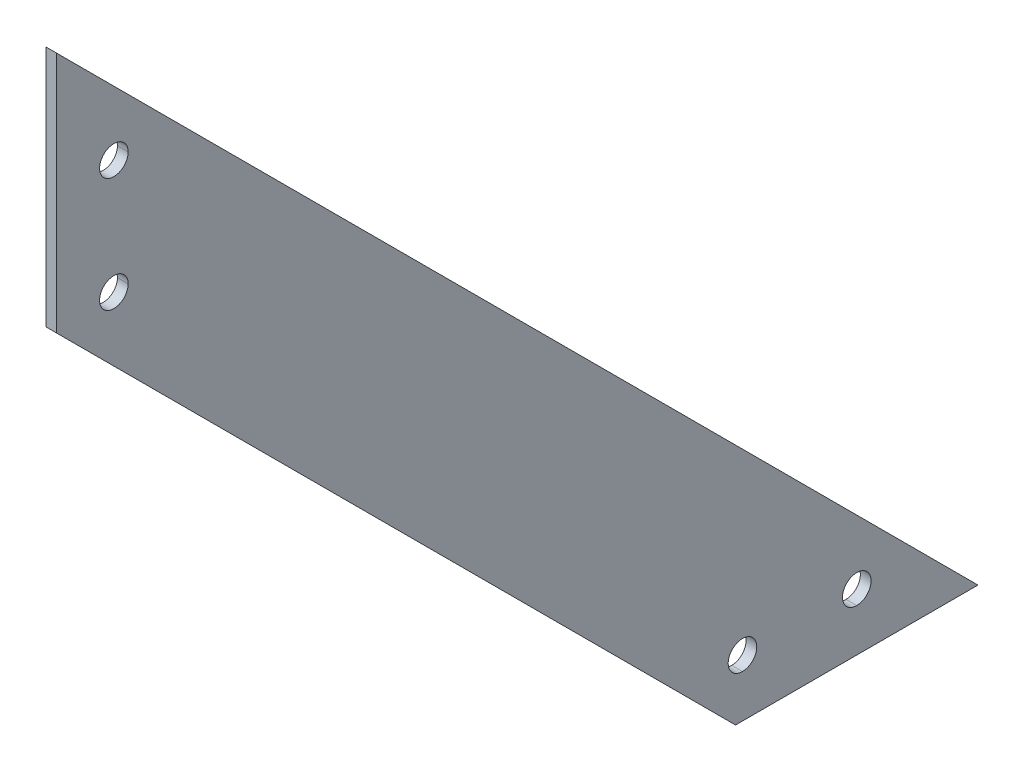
ISO-10303-21;
HEADER;
FILE_DESCRIPTION(('STEP AP214'),'2;1');
FILE_NAME('part.step','',(''),(''),'','','');
FILE_SCHEMA(('AUTOMOTIVE_DESIGN { 1 0 10303 214 1 1 1 1 }'));
ENDSEC;
DATA;
#1=APPLICATION_CONTEXT('core data for automotive mechanical design processes');
#2=APPLICATION_PROTOCOL_DEFINITION('international standard','automotive_design',2000,#1);
#3=PRODUCT_CONTEXT('',#1,'mechanical');
#4=PRODUCT('Part','Part','',(#3));
#5=PRODUCT_RELATED_PRODUCT_CATEGORY('part','',(#4));
#6=PRODUCT_DEFINITION_FORMATION('','',#4);
#7=PRODUCT_DEFINITION_CONTEXT('part definition',#1,'design');
#8=PRODUCT_DEFINITION('design','',#6,#7);
#9=PRODUCT_DEFINITION_SHAPE('','',#8);
#10=(LENGTH_UNIT() NAMED_UNIT(*) SI_UNIT(.MILLI.,.METRE.));
#11=(NAMED_UNIT(*) PLANE_ANGLE_UNIT() SI_UNIT($,.RADIAN.));
#12=(NAMED_UNIT(*) SI_UNIT($,.STERADIAN.) SOLID_ANGLE_UNIT());
#13=UNCERTAINTY_MEASURE_WITH_UNIT(LENGTH_MEASURE(1.E-05),#10,'distance_accuracy_value','');
#14=(GEOMETRIC_REPRESENTATION_CONTEXT(3) GLOBAL_UNCERTAINTY_ASSIGNED_CONTEXT((#13)) GLOBAL_UNIT_ASSIGNED_CONTEXT((#10,
#11,#12)) REPRESENTATION_CONTEXT('',''));
#15=CARTESIAN_POINT('',(0.,0.,0.));
#16=DIRECTION('',(0.,0.,1.));
#17=DIRECTION('',(1.,0.,0.));
#18=AXIS2_PLACEMENT_3D('',#15,#16,#17);
#19=CARTESIAN_POINT('',(-2.38124999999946,-204.740768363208,-96.9776949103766));
#20=DIRECTION('',(-1.,0.,0.));
#21=DIRECTION('',(0.,0.,1.));
#22=AXIS2_PLACEMENT_3D('',#19,#20,#21);
#23=PLANE('',#22);
#24=DIRECTION('',(0.,0.707106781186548,0.707106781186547));
#25=VECTOR('',#24,1.);
#26=CARTESIAN_POINT('',(-2.38124999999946,204.740768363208,204.740768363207));
#27=LINE('',#26,#25);
#28=CARTESIAN_POINT('',(-2.38124999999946,-204.740768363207,-204.740768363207));
#29=VERTEX_POINT('',#28);
#30=CARTESIAN_POINT('',(-2.38124999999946,204.740768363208,204.740768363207));
#31=VERTEX_POINT('',#30);
#32=EDGE_CURVE('E228',#29,#31,#27,.T.);
#33=ORIENTED_EDGE('',*,*,#32,.F.);
#34=DIRECTION('',(0.,0.,-1.));
#35=VECTOR('',#34,1.);
#36=CARTESIAN_POINT('',(-2.38124999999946,-204.740768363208,-100.059231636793));
#37=LINE('',#36,#35);
#38=CARTESIAN_POINT('',(-2.38124999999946,-204.740768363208,-96.9776949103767));
#39=VERTEX_POINT('',#38);
#40=EDGE_CURVE('E255',#39,#29,#37,.T.);
#41=ORIENTED_EDGE('',*,*,#40,.F.);
#42=DIRECTION('',(0.,-0.707106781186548,-0.707106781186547));
#43=VECTOR('',#42,1.);
#44=CARTESIAN_POINT('',(-2.38124999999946,-204.740768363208,-96.9776949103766));
#45=LINE('',#44,#43);
#46=CARTESIAN_POINT('',(-2.38124999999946,96.9776949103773,204.740768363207));
#47=VERTEX_POINT('',#46);
#48=EDGE_CURVE('E246',#47,#39,#45,.T.);
#49=ORIENTED_EDGE('',*,*,#48,.F.);
#50=DIRECTION('',(0.,1.,0.));
#51=VECTOR('',#50,1.);
#52=CARTESIAN_POINT('',(-2.38124999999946,96.9776949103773,204.740768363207));
#53=LINE('',#52,#51);
#54=EDGE_CURVE('E248',#31,#47,#53,.F.);
#55=ORIENTED_EDGE('',*,*,#54,.F.);
#56=EDGE_LOOP('',(#33,#41,#49,#55));
#57=FACE_BOUND('',#56,.T.);
#58=CARTESIAN_POINT('',(-2.38124999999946,-179.340768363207,-100.059231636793));
#59=DIRECTION('',(1.,0.,0.));
#60=DIRECTION('',(0.,1.,0.));
#61=AXIS2_PLACEMENT_3D('',#58,#59,#60);
#62=CIRCLE('',#61,6.35);
#63=CARTESIAN_POINT('',(-2.38125,-185.690768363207,-100.059231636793));
#64=VERTEX_POINT('',#63);
#65=CARTESIAN_POINT('',(-2.38125,-172.990768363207,-100.059231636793));
#66=VERTEX_POINT('',#65);
#67=EDGE_CURVE('E143',#64,#66,#62,.T.);
#68=ORIENTED_EDGE('',*,*,#67,.T.);
#69=CARTESIAN_POINT('',(-2.38125000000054,-179.340768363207,-100.059231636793));
#70=DIRECTION('',(1.,0.,0.));
#71=DIRECTION('',(0.,1.,0.));
#72=AXIS2_PLACEMENT_3D('',#69,#70,#71);
#73=CIRCLE('',#72,6.35);
#74=EDGE_CURVE('E148',#66,#64,#73,.T.);
#75=ORIENTED_EDGE('',*,*,#74,.T.);
#76=EDGE_LOOP('',(#68,#75));
#77=FACE_BOUND('',#76,.T.);
#78=CARTESIAN_POINT('',(-2.38124999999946,-179.340768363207,-150.859231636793));
#79=DIRECTION('',(1.,0.,0.));
#80=DIRECTION('',(0.,1.,0.));
#81=AXIS2_PLACEMENT_3D('',#78,#79,#80);
#82=CIRCLE('',#81,6.35);
#83=CARTESIAN_POINT('',(-2.38125,-185.690768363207,-150.859231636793));
#84=VERTEX_POINT('',#83);
#85=CARTESIAN_POINT('',(-2.38125,-172.990768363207,-150.859231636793));
#86=VERTEX_POINT('',#85);
#87=EDGE_CURVE('E151',#84,#86,#82,.T.);
#88=ORIENTED_EDGE('',*,*,#87,.T.);
#89=CARTESIAN_POINT('',(-2.38125000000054,-179.340768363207,-150.859231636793));
#90=DIRECTION('',(1.,0.,0.));
#91=DIRECTION('',(0.,1.,0.));
#92=AXIS2_PLACEMENT_3D('',#89,#90,#91);
#93=CIRCLE('',#92,6.35);
#94=EDGE_CURVE('E155',#86,#84,#93,.T.);
#95=ORIENTED_EDGE('',*,*,#94,.T.);
#96=EDGE_LOOP('',(#88,#95));
#97=FACE_BOUND('',#96,.T.);
#98=CARTESIAN_POINT('',(-2.38124999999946,100.059231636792,179.340768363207));
#99=DIRECTION('',(-1.,0.,0.));
#100=DIRECTION('',(0.,0.,1.));
#101=AXIS2_PLACEMENT_3D('',#98,#99,#100);
#102=CIRCLE('',#101,6.35);
#103=CARTESIAN_POINT('',(-2.38125,100.059231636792,185.690768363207));
#104=VERTEX_POINT('',#103);
#105=CARTESIAN_POINT('',(-2.38125,100.059231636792,172.990768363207));
#106=VERTEX_POINT('',#105);
#107=EDGE_CURVE('E158',#104,#106,#102,.F.);
#108=ORIENTED_EDGE('',*,*,#107,.T.);
#109=CARTESIAN_POINT('',(-2.38125000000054,100.059231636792,179.340768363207));
#110=DIRECTION('',(-1.,0.,0.));
#111=DIRECTION('',(0.,0.,1.));
#112=AXIS2_PLACEMENT_3D('',#109,#110,#111);
#113=CIRCLE('',#112,6.35);
#114=EDGE_CURVE('E162',#106,#104,#113,.F.);
#115=ORIENTED_EDGE('',*,*,#114,.T.);
#116=EDGE_LOOP('',(#108,#115));
#117=FACE_BOUND('',#116,.T.);
#118=CARTESIAN_POINT('',(-2.38124999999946,150.859231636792,179.340768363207));
#119=DIRECTION('',(-1.,0.,0.));
#120=DIRECTION('',(0.,0.,1.));
#121=AXIS2_PLACEMENT_3D('',#118,#119,#120);
#122=CIRCLE('',#121,6.35);
#123=CARTESIAN_POINT('',(-2.38125,150.859231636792,185.690768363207));
#124=VERTEX_POINT('',#123);
#125=CARTESIAN_POINT('',(-2.38125,150.859231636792,172.990768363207));
#126=VERTEX_POINT('',#125);
#127=EDGE_CURVE('E106',#124,#126,#122,.F.);
#128=ORIENTED_EDGE('',*,*,#127,.T.);
#129=CARTESIAN_POINT('',(-2.38125000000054,150.859231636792,179.340768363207));
#130=DIRECTION('',(-1.,0.,0.));
#131=DIRECTION('',(0.,0.,1.));
#132=AXIS2_PLACEMENT_3D('',#129,#130,#131);
#133=CIRCLE('',#132,6.35);
#134=EDGE_CURVE('E19',#126,#124,#133,.F.);
#135=ORIENTED_EDGE('',*,*,#134,.T.);
#136=EDGE_LOOP('',(#128,#135));
#137=FACE_BOUND('',#136,.T.);
#138=ADVANCED_FACE('F16',(#57,#77,#97,#117,#137),#23,.T.);
#139=CARTESIAN_POINT('',(15.3987500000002,150.859231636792,179.340768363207));
#140=DIRECTION('',(-1.,0.,0.));
#141=DIRECTION('',(0.,0.,1.));
#142=AXIS2_PLACEMENT_3D('',#139,#140,#141);
#143=CYLINDRICAL_SURFACE('',#142,6.35);
#144=CARTESIAN_POINT('',(2.38125000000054,150.859231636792,179.340768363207));
#145=DIRECTION('',(-1.,0.,0.));
#146=DIRECTION('',(0.,0.,1.));
#147=AXIS2_PLACEMENT_3D('',#144,#145,#146);
#148=CIRCLE('',#147,6.35);
#149=CARTESIAN_POINT('',(2.38125000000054,150.859231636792,172.990768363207));
#150=VERTEX_POINT('',#149);
#151=CARTESIAN_POINT('',(2.38125000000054,150.859231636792,185.690768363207));
#152=VERTEX_POINT('',#151);
#153=EDGE_CURVE('E115',#150,#152,#148,.F.);
#154=ORIENTED_EDGE('',*,*,#153,.T.);
#155=DIRECTION('',(-1.,0.,0.));
#156=VECTOR('',#155,1.);
#157=CARTESIAN_POINT('',(15.3987500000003,150.859231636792,185.690768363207));
#158=LINE('',#157,#156);
#159=EDGE_CURVE('E107',#152,#124,#158,.T.);
#160=ORIENTED_EDGE('',*,*,#159,.T.);
#161=ORIENTED_EDGE('',*,*,#134,.F.);
#162=DIRECTION('',(-1.,0.,0.));
#163=VECTOR('',#162,1.);
#164=CARTESIAN_POINT('',(15.3987500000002,150.859231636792,172.990768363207));
#165=LINE('',#164,#163);
#166=EDGE_CURVE('E112',#126,#150,#165,.F.);
#167=ORIENTED_EDGE('',*,*,#166,.T.);
#168=EDGE_LOOP('',(#154,#160,#161,#167));
#169=FACE_BOUND('',#168,.T.);
#170=ADVANCED_FACE('F114',(#169),#143,.F.);
#171=CARTESIAN_POINT('',(15.3987500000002,150.859231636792,179.340768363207));
#172=DIRECTION('',(-1.,0.,0.));
#173=DIRECTION('',(0.,0.,1.));
#174=AXIS2_PLACEMENT_3D('',#171,#172,#173);
#175=CYLINDRICAL_SURFACE('',#174,6.35);
#176=ORIENTED_EDGE('',*,*,#127,.F.);
#177=ORIENTED_EDGE('',*,*,#159,.F.);
#178=CARTESIAN_POINT('',(2.38125000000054,150.859231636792,179.340768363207));
#179=DIRECTION('',(-1.,0.,0.));
#180=DIRECTION('',(0.,0.,1.));
#181=AXIS2_PLACEMENT_3D('',#178,#179,#180);
#182=CIRCLE('',#181,6.35);
#183=EDGE_CURVE('E139',#152,#150,#182,.F.);
#184=ORIENTED_EDGE('',*,*,#183,.T.);
#185=ORIENTED_EDGE('',*,*,#166,.F.);
#186=EDGE_LOOP('',(#176,#177,#184,#185));
#187=FACE_BOUND('',#186,.T.);
#188=ADVANCED_FACE('F109',(#187),#175,.F.);
#189=CARTESIAN_POINT('',(15.3987500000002,100.059231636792,179.340768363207));
#190=DIRECTION('',(-1.,0.,0.));
#191=DIRECTION('',(0.,0.,1.));
#192=AXIS2_PLACEMENT_3D('',#189,#190,#191);
#193=CYLINDRICAL_SURFACE('',#192,6.35);
#194=CARTESIAN_POINT('',(2.38125000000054,100.059231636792,179.340768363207));
#195=DIRECTION('',(-1.,0.,0.));
#196=DIRECTION('',(0.,0.,1.));
#197=AXIS2_PLACEMENT_3D('',#194,#195,#196);
#198=CIRCLE('',#197,6.35);
#199=CARTESIAN_POINT('',(2.38125000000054,100.059231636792,172.990768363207));
#200=VERTEX_POINT('',#199);
#201=CARTESIAN_POINT('',(2.38125000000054,100.059231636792,185.690768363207));
#202=VERTEX_POINT('',#201);
#203=EDGE_CURVE('E136',#200,#202,#198,.F.);
#204=ORIENTED_EDGE('',*,*,#203,.T.);
#205=DIRECTION('',(-1.,0.,0.));
#206=VECTOR('',#205,1.);
#207=CARTESIAN_POINT('',(15.3987500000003,100.059231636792,185.690768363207));
#208=LINE('',#207,#206);
#209=EDGE_CURVE('E161',#202,#104,#208,.T.);
#210=ORIENTED_EDGE('',*,*,#209,.T.);
#211=ORIENTED_EDGE('',*,*,#114,.F.);
#212=DIRECTION('',(-1.,0.,0.));
#213=VECTOR('',#212,1.);
#214=CARTESIAN_POINT('',(15.3987500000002,100.059231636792,172.990768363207));
#215=LINE('',#214,#213);
#216=EDGE_CURVE('E157',#106,#200,#215,.F.);
#217=ORIENTED_EDGE('',*,*,#216,.T.);
#218=EDGE_LOOP('',(#204,#210,#211,#217));
#219=FACE_BOUND('',#218,.T.);
#220=ADVANCED_FACE('F211',(#219),#193,.F.);
#221=CARTESIAN_POINT('',(15.3987500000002,100.059231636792,179.340768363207));
#222=DIRECTION('',(-1.,0.,0.));
#223=DIRECTION('',(0.,0.,1.));
#224=AXIS2_PLACEMENT_3D('',#221,#222,#223);
#225=CYLINDRICAL_SURFACE('',#224,6.35);
#226=ORIENTED_EDGE('',*,*,#107,.F.);
#227=ORIENTED_EDGE('',*,*,#209,.F.);
#228=CARTESIAN_POINT('',(2.38125000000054,100.059231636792,179.340768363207));
#229=DIRECTION('',(-1.,0.,0.));
#230=DIRECTION('',(0.,0.,1.));
#231=AXIS2_PLACEMENT_3D('',#228,#229,#230);
#232=CIRCLE('',#231,6.35);
#233=EDGE_CURVE('E133',#202,#200,#232,.F.);
#234=ORIENTED_EDGE('',*,*,#233,.T.);
#235=ORIENTED_EDGE('',*,*,#216,.F.);
#236=EDGE_LOOP('',(#226,#227,#234,#235));
#237=FACE_BOUND('',#236,.T.);
#238=ADVANCED_FACE('F207',(#237),#225,.F.);
#239=CARTESIAN_POINT('',(15.3987500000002,-179.340768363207,-150.859231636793));
#240=DIRECTION('',(1.,0.,0.));
#241=DIRECTION('',(0.,1.,0.));
#242=AXIS2_PLACEMENT_3D('',#239,#240,#241);
#243=CYLINDRICAL_SURFACE('',#242,6.35);
#244=CARTESIAN_POINT('',(2.38125000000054,-179.340768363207,-150.859231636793));
#245=DIRECTION('',(1.,0.,0.));
#246=DIRECTION('',(0.,1.,0.));
#247=AXIS2_PLACEMENT_3D('',#244,#245,#246);
#248=CIRCLE('',#247,6.35);
#249=CARTESIAN_POINT('',(2.38125000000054,-172.990768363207,-150.859231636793));
#250=VERTEX_POINT('',#249);
#251=CARTESIAN_POINT('',(2.38125000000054,-185.690768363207,-150.859231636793));
#252=VERTEX_POINT('',#251);
#253=EDGE_CURVE('E130',#250,#252,#248,.T.);
#254=ORIENTED_EDGE('',*,*,#253,.T.);
#255=DIRECTION('',(1.,0.,0.));
#256=VECTOR('',#255,1.);
#257=CARTESIAN_POINT('',(15.3987500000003,-185.690768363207,-150.859231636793));
#258=LINE('',#257,#256);
#259=EDGE_CURVE('E154',#252,#84,#258,.F.);
#260=ORIENTED_EDGE('',*,*,#259,.T.);
#261=ORIENTED_EDGE('',*,*,#94,.F.);
#262=DIRECTION('',(1.,0.,0.));
#263=VECTOR('',#262,1.);
#264=CARTESIAN_POINT('',(15.3987500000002,-172.990768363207,-150.859231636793));
#265=LINE('',#264,#263);
#266=EDGE_CURVE('E150',#86,#250,#265,.T.);
#267=ORIENTED_EDGE('',*,*,#266,.T.);
#268=EDGE_LOOP('',(#254,#260,#261,#267));
#269=FACE_BOUND('',#268,.T.);
#270=ADVANCED_FACE('F203',(#269),#243,.F.);
#271=CARTESIAN_POINT('',(15.3987500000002,-179.340768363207,-150.859231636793));
#272=DIRECTION('',(1.,0.,0.));
#273=DIRECTION('',(0.,1.,0.));
#274=AXIS2_PLACEMENT_3D('',#271,#272,#273);
#275=CYLINDRICAL_SURFACE('',#274,6.35);
#276=ORIENTED_EDGE('',*,*,#87,.F.);
#277=ORIENTED_EDGE('',*,*,#259,.F.);
#278=CARTESIAN_POINT('',(2.38125000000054,-179.340768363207,-150.859231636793));
#279=DIRECTION('',(1.,0.,0.));
#280=DIRECTION('',(0.,1.,0.));
#281=AXIS2_PLACEMENT_3D('',#278,#279,#280);
#282=CIRCLE('',#281,6.35);
#283=EDGE_CURVE('E127',#252,#250,#282,.T.);
#284=ORIENTED_EDGE('',*,*,#283,.T.);
#285=ORIENTED_EDGE('',*,*,#266,.F.);
#286=EDGE_LOOP('',(#276,#277,#284,#285));
#287=FACE_BOUND('',#286,.T.);
#288=ADVANCED_FACE('F199',(#287),#275,.F.);
#289=CARTESIAN_POINT('',(15.3987500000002,-179.340768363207,-100.059231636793));
#290=DIRECTION('',(1.,0.,0.));
#291=DIRECTION('',(0.,1.,0.));
#292=AXIS2_PLACEMENT_3D('',#289,#290,#291);
#293=CYLINDRICAL_SURFACE('',#292,6.35);
#294=CARTESIAN_POINT('',(2.38125000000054,-179.340768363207,-100.059231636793));
#295=DIRECTION('',(1.,0.,0.));
#296=DIRECTION('',(0.,1.,0.));
#297=AXIS2_PLACEMENT_3D('',#294,#295,#296);
#298=CIRCLE('',#297,6.35);
#299=CARTESIAN_POINT('',(2.38125000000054,-172.990768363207,-100.059231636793));
#300=VERTEX_POINT('',#299);
#301=CARTESIAN_POINT('',(2.38125000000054,-185.690768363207,-100.059231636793));
#302=VERTEX_POINT('',#301);
#303=EDGE_CURVE('E124',#300,#302,#298,.T.);
#304=ORIENTED_EDGE('',*,*,#303,.T.);
#305=DIRECTION('',(1.,0.,0.));
#306=VECTOR('',#305,1.);
#307=CARTESIAN_POINT('',(15.3987500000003,-185.690768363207,-100.059231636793));
#308=LINE('',#307,#306);
#309=EDGE_CURVE('E147',#302,#64,#308,.F.);
#310=ORIENTED_EDGE('',*,*,#309,.T.);
#311=ORIENTED_EDGE('',*,*,#74,.F.);
#312=DIRECTION('',(1.,0.,0.));
#313=VECTOR('',#312,1.);
#314=CARTESIAN_POINT('',(15.3987500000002,-172.990768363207,-100.059231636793));
#315=LINE('',#314,#313);
#316=EDGE_CURVE('E146',#66,#300,#315,.T.);
#317=ORIENTED_EDGE('',*,*,#316,.T.);
#318=EDGE_LOOP('',(#304,#310,#311,#317));
#319=FACE_BOUND('',#318,.T.);
#320=ADVANCED_FACE('F195',(#319),#293,.F.);
#321=CARTESIAN_POINT('',(15.3987500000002,-179.340768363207,-100.059231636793));
#322=DIRECTION('',(1.,0.,0.));
#323=DIRECTION('',(0.,1.,0.));
#324=AXIS2_PLACEMENT_3D('',#321,#322,#323);
#325=CYLINDRICAL_SURFACE('',#324,6.35);
#326=ORIENTED_EDGE('',*,*,#67,.F.);
#327=ORIENTED_EDGE('',*,*,#309,.F.);
#328=CARTESIAN_POINT('',(2.38125000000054,-179.340768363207,-100.059231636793));
#329=DIRECTION('',(1.,0.,0.));
#330=DIRECTION('',(0.,1.,0.));
#331=AXIS2_PLACEMENT_3D('',#328,#329,#330);
#332=CIRCLE('',#331,6.35);
#333=EDGE_CURVE('E120',#302,#300,#332,.T.);
#334=ORIENTED_EDGE('',*,*,#333,.T.);
#335=ORIENTED_EDGE('',*,*,#316,.F.);
#336=EDGE_LOOP('',(#326,#327,#334,#335));
#337=FACE_BOUND('',#336,.T.);
#338=ADVANCED_FACE('F191',(#337),#325,.F.);
#339=CARTESIAN_POINT('',(2.38124999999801,-204.740768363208,-96.9776949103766));
#340=DIRECTION('',(0.,-0.707106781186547,0.707106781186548));
#341=DIRECTION('',(0.,-0.707106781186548,-0.707106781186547));
#342=AXIS2_PLACEMENT_3D('',#339,#340,#341);
#343=PLANE('',#342);
#344=DIRECTION('',(0.,0.707106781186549,0.707106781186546));
#345=VECTOR('',#344,1.);
#346=CARTESIAN_POINT('',(2.38124999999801,-204.740768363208,-96.9776949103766));
#347=LINE('',#346,#345);
#348=CARTESIAN_POINT('',(2.38124999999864,-204.740768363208,-96.9776949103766));
#349=VERTEX_POINT('',#348);
#350=CARTESIAN_POINT('',(2.38124999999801,96.9776949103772,204.740768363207));
#351=VERTEX_POINT('',#350);
#352=EDGE_CURVE('E123',#349,#351,#347,.T.);
#353=ORIENTED_EDGE('',*,*,#352,.T.);
#354=DIRECTION('',(1.,0.,0.));
#355=VECTOR('',#354,1.);
#356=CARTESIAN_POINT('',(2.38124999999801,96.9776949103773,204.740768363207));
#357=LINE('',#356,#355);
#358=EDGE_CURVE('E250',#47,#351,#357,.T.);
#359=ORIENTED_EDGE('',*,*,#358,.F.);
#360=ORIENTED_EDGE('',*,*,#48,.T.);
#361=DIRECTION('',(1.,0.,0.));
#362=VECTOR('',#361,1.);
#363=CARTESIAN_POINT('',(2.38124999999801,-204.740768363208,-96.9776949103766));
#364=LINE('',#363,#362);
#365=EDGE_CURVE('E142',#349,#39,#364,.F.);
#366=ORIENTED_EDGE('',*,*,#365,.F.);
#367=EDGE_LOOP('',(#353,#359,#360,#366));
#368=FACE_BOUND('',#367,.T.);
#369=ADVANCED_FACE('F187',(#368),#343,.T.);
#370=CARTESIAN_POINT('',(2.38124999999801,96.9776949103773,204.740768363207));
#371=DIRECTION('',(0.,0.,1.));
#372=DIRECTION('',(1.,0.,0.));
#373=AXIS2_PLACEMENT_3D('',#370,#371,#372);
#374=PLANE('',#373);
#375=DIRECTION('',(0.,1.,0.));
#376=VECTOR('',#375,1.);
#377=CARTESIAN_POINT('',(2.38124999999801,-53.1111525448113,204.740768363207));
#378=LINE('',#377,#376);
#379=CARTESIAN_POINT('',(2.38124999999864,204.740768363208,204.740768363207));
#380=VERTEX_POINT('',#379);
#381=EDGE_CURVE('E262',#351,#380,#378,.T.);
#382=ORIENTED_EDGE('',*,*,#381,.T.);
#383=DIRECTION('',(1.,0.,0.));
#384=VECTOR('',#383,1.);
#385=CARTESIAN_POINT('',(2.38125000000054,204.740768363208,204.740768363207));
#386=LINE('',#385,#384);
#387=EDGE_CURVE('E253',#31,#380,#386,.T.);
#388=ORIENTED_EDGE('',*,*,#387,.F.);
#389=ORIENTED_EDGE('',*,*,#54,.T.);
#390=ORIENTED_EDGE('',*,*,#358,.T.);
#391=EDGE_LOOP('',(#382,#388,#389,#390));
#392=FACE_BOUND('',#391,.T.);
#393=ADVANCED_FACE('F183',(#392),#374,.T.);
#394=CARTESIAN_POINT('',(2.38125000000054,204.740768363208,204.740768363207));
#395=DIRECTION('',(0.,0.707106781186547,-0.707106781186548));
#396=DIRECTION('',(0.,0.707106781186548,0.707106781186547));
#397=AXIS2_PLACEMENT_3D('',#394,#395,#396);
#398=PLANE('',#397);
#399=DIRECTION('',(0.,-0.707106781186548,-0.707106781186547));
#400=VECTOR('',#399,1.);
#401=CARTESIAN_POINT('',(2.38124999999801,204.740768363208,204.740768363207));
#402=LINE('',#401,#400);
#403=CARTESIAN_POINT('',(2.38124999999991,-204.740768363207,-204.740768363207));
#404=VERTEX_POINT('',#403);
#405=EDGE_CURVE('E25',#380,#404,#402,.T.);
#406=ORIENTED_EDGE('',*,*,#405,.T.);
#407=DIRECTION('',(1.,0.,0.));
#408=VECTOR('',#407,1.);
#409=CARTESIAN_POINT('',(2.38124999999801,-204.740768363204,-204.740768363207));
#410=LINE('',#409,#408);
#411=EDGE_CURVE('E33',#29,#404,#410,.T.);
#412=ORIENTED_EDGE('',*,*,#411,.F.);
#413=ORIENTED_EDGE('',*,*,#32,.T.);
#414=ORIENTED_EDGE('',*,*,#387,.T.);
#415=EDGE_LOOP('',(#406,#412,#413,#414));
#416=FACE_BOUND('',#415,.T.);
#417=ADVANCED_FACE('F176',(#416),#398,.T.);
#418=CARTESIAN_POINT('',(2.38124999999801,-204.740768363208,-100.059231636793));
#419=DIRECTION('',(0.,-1.,0.));
#420=DIRECTION('',(0.,0.,-1.));
#421=AXIS2_PLACEMENT_3D('',#418,#419,#420);
#422=PLANE('',#421);
#423=DIRECTION('',(0.,0.,1.));
#424=VECTOR('',#423,1.);
#425=CARTESIAN_POINT('',(2.38124999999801,-204.740768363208,53.1111525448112));
#426=LINE('',#425,#424);
#427=EDGE_CURVE('E11',#404,#349,#426,.T.);
#428=ORIENTED_EDGE('',*,*,#427,.T.);
#429=ORIENTED_EDGE('',*,*,#365,.T.);
#430=ORIENTED_EDGE('',*,*,#40,.T.);
#431=ORIENTED_EDGE('',*,*,#411,.T.);
#432=EDGE_LOOP('',(#428,#429,#430,#431));
#433=FACE_BOUND('',#432,.T.);
#434=ADVANCED_FACE('F169',(#433),#422,.T.);
#435=CARTESIAN_POINT('',(2.38124999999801,-53.1111525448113,53.1111525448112));
#436=DIRECTION('',(-1.,0.,0.));
#437=DIRECTION('',(0.,0.,1.));
#438=AXIS2_PLACEMENT_3D('',#435,#436,#437);
#439=PLANE('',#438);
#440=ORIENTED_EDGE('',*,*,#405,.F.);
#441=ORIENTED_EDGE('',*,*,#381,.F.);
#442=ORIENTED_EDGE('',*,*,#352,.F.);
#443=ORIENTED_EDGE('',*,*,#427,.F.);
#444=EDGE_LOOP('',(#440,#441,#442,#443));
#445=FACE_BOUND('',#444,.T.);
#446=ORIENTED_EDGE('',*,*,#303,.F.);
#447=ORIENTED_EDGE('',*,*,#333,.F.);
#448=EDGE_LOOP('',(#446,#447));
#449=FACE_BOUND('',#448,.T.);
#450=ORIENTED_EDGE('',*,*,#253,.F.);
#451=ORIENTED_EDGE('',*,*,#283,.F.);
#452=EDGE_LOOP('',(#450,#451));
#453=FACE_BOUND('',#452,.T.);
#454=ORIENTED_EDGE('',*,*,#203,.F.);
#455=ORIENTED_EDGE('',*,*,#233,.F.);
#456=EDGE_LOOP('',(#454,#455));
#457=FACE_BOUND('',#456,.T.);
#458=ORIENTED_EDGE('',*,*,#153,.F.);
#459=ORIENTED_EDGE('',*,*,#183,.F.);
#460=EDGE_LOOP('',(#458,#459));
#461=FACE_BOUND('',#460,.T.);
#462=ADVANCED_FACE('F167',(#445,#449,#453,#457,#461),#439,.F.);
#463=CLOSED_SHELL('',(#138,#170,#188,#220,#238,#270,#288,#320,#338,#369,#393,#417,#434,#462));
#464=MANIFOLD_SOLID_BREP('B1',#463);
#465=ADVANCED_BREP_SHAPE_REPRESENTATION('',(#18,#464),#14);
#466=SHAPE_DEFINITION_REPRESENTATION(#9,#465);
ENDSEC;
END-ISO-10303-21;
